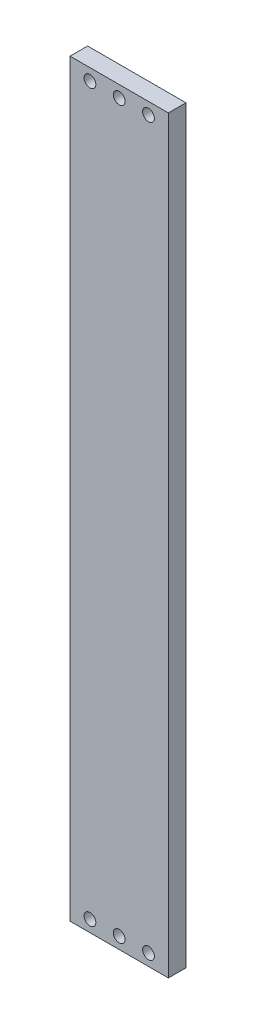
from build123d import *

# Parameters (mm, degrees)
CROQUIS1_W              = 16.8005
CROQUIS1_H              = 128
CROQUIS1_R              = 1
SALIENTE_EXTRUIR2_DEPTH = 3


with BuildPart() as part:
    # Croquis1 → Saliente-Extruir2 (new body)
    with BuildSketch(Plane.XY):
        with Locations((0, -59)):
            Rectangle(CROQUIS1_W, CROQUIS1_H)
        with Locations((0, -121)):
            Circle(CROQUIS1_R, mode=Mode.SUBTRACT)
        with Locations((5, -121)):
            Circle(CROQUIS1_R, mode=Mode.SUBTRACT)
        with Locations((-5, -121)):
            Circle(CROQUIS1_R, mode=Mode.SUBTRACT)
        with Locations(Location((5, 3, 0), (0, 0, 180))):
            Circle(CROQUIS1_R, mode=Mode.SUBTRACT)
        with Locations(Location((0, 3, 0), (0, 0, 180))):
            Circle(CROQUIS1_R, mode=Mode.SUBTRACT)
        with Locations(Location((-5, 3, 0), (0, 0, 180))):
            Circle(CROQUIS1_R, mode=Mode.SUBTRACT)
    extrude(amount=SALIENTE_EXTRUIR2_DEPTH)


solid = part.part
